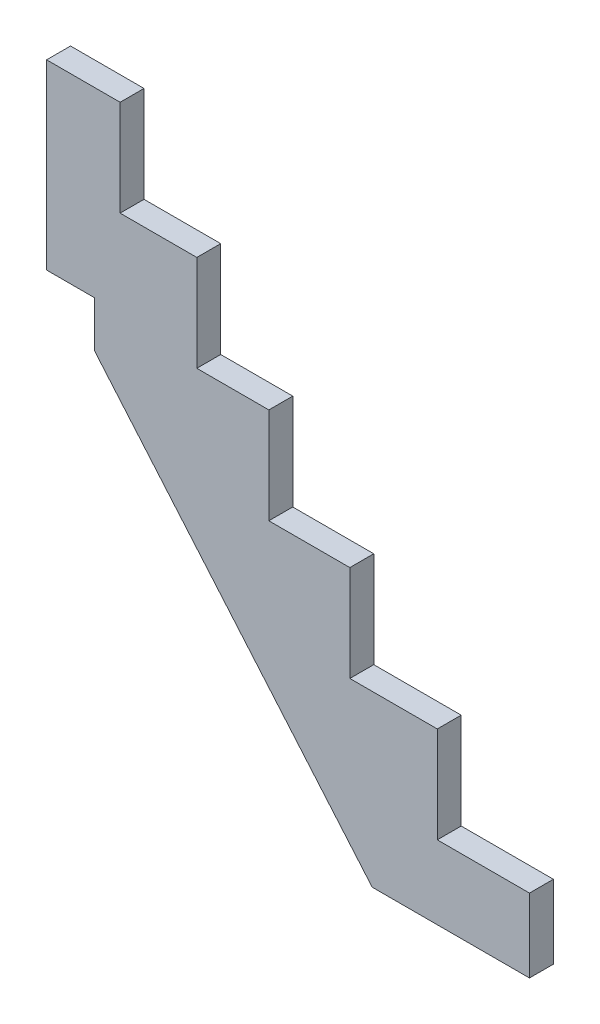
from build123d import *

# Parameters (mm, degrees)
EXTRUDE_1_DEPTH = 50


with BuildPart() as part:
    # Sketch 1 → Extrude 1 (new body)
    with BuildSketch(Plane.XY):
        Polygon((-92.171981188, -1842.246045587), (-284.899836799, -1842.246045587), (-284.899836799, -1641.476045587), (-467.703134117, -1641.476045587), (-467.703134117, -1440.706045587), (-637.048224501, -1440.706045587), (-637.048224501, -1239.936045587), (-787.632927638, -1239.936045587), (-787.632927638, -1039.166045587), (-947.974076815, -1039.166045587), (-947.974076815, -838.396045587), (-1101.632738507, -838.396045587), (-1101.632738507, -1219.088290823), (-1001.632738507, -1219.088290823), (-1001.632738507, -1314.944687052), (-421.005856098, -1996.016045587), (-92.171981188, -1996.016045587), align=None)
    extrude(amount=EXTRUDE_1_DEPTH)


solid = part.part
